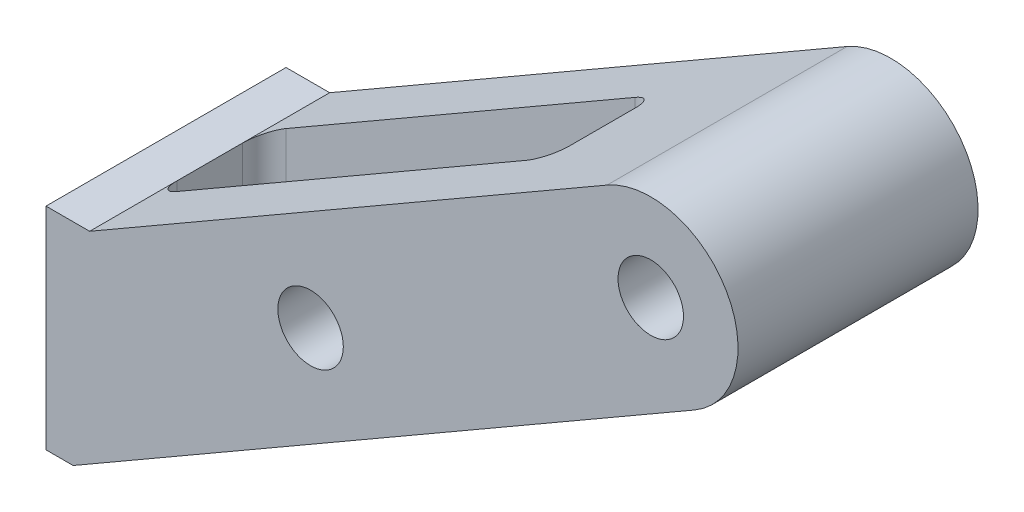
ISO-10303-21;
HEADER;
FILE_DESCRIPTION(('STEP AP214'),'2;1');
FILE_NAME('part.step','',(''),(''),'','','');
FILE_SCHEMA(('AUTOMOTIVE_DESIGN { 1 0 10303 214 1 1 1 1 }'));
ENDSEC;
DATA;
#1=APPLICATION_CONTEXT('core data for automotive mechanical design processes');
#2=APPLICATION_PROTOCOL_DEFINITION('international standard','automotive_design',2000,#1);
#3=PRODUCT_CONTEXT('',#1,'mechanical');
#4=PRODUCT('Part','Part','',(#3));
#5=PRODUCT_RELATED_PRODUCT_CATEGORY('part','',(#4));
#6=PRODUCT_DEFINITION_FORMATION('','',#4);
#7=PRODUCT_DEFINITION_CONTEXT('part definition',#1,'design');
#8=PRODUCT_DEFINITION('design','',#6,#7);
#9=PRODUCT_DEFINITION_SHAPE('','',#8);
#10=(LENGTH_UNIT() NAMED_UNIT(*) SI_UNIT(.MILLI.,.METRE.));
#11=(NAMED_UNIT(*) PLANE_ANGLE_UNIT() SI_UNIT($,.RADIAN.));
#12=(NAMED_UNIT(*) SI_UNIT($,.STERADIAN.) SOLID_ANGLE_UNIT());
#13=UNCERTAINTY_MEASURE_WITH_UNIT(LENGTH_MEASURE(1.E-05),#10,'distance_accuracy_value','');
#14=(GEOMETRIC_REPRESENTATION_CONTEXT(3) GLOBAL_UNCERTAINTY_ASSIGNED_CONTEXT((#13)) GLOBAL_UNIT_ASSIGNED_CONTEXT((#10,
#11,#12)) REPRESENTATION_CONTEXT('',''));
#15=CARTESIAN_POINT('',(0.,0.,0.));
#16=DIRECTION('',(0.,0.,1.));
#17=DIRECTION('',(1.,0.,0.));
#18=AXIS2_PLACEMENT_3D('',#15,#16,#17);
#19=CARTESIAN_POINT('',(24.2487113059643,14.,11.));
#20=DIRECTION('',(0.,0.,1.));
#21=DIRECTION('',(1.,0.,0.));
#22=AXIS2_PLACEMENT_3D('',#19,#20,#21);
#23=CYLINDRICAL_SURFACE('',#22,2.99999999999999);
#24=CARTESIAN_POINT('',(24.2487113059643,14.,-5.));
#25=DIRECTION('',(0.,0.,-1.));
#26=DIRECTION('',(-1.,0.,0.));
#27=AXIS2_PLACEMENT_3D('',#24,#25,#26);
#28=CIRCLE('',#27,2.99999999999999);
#29=CARTESIAN_POINT('',(21.2487113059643,14.,-5.));
#30=VERTEX_POINT('',#29);
#31=EDGE_CURVE('E197',#30,#30,#28,.F.);
#32=ORIENTED_EDGE('',*,*,#31,.T.);
#33=EDGE_LOOP('',(#32));
#34=FACE_BOUND('',#33,.T.);
#35=CARTESIAN_POINT('',(24.2487113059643,14.,-11.));
#36=DIRECTION('',(0.,0.,1.));
#37=DIRECTION('',(1.,0.,0.));
#38=AXIS2_PLACEMENT_3D('',#35,#36,#37);
#39=CIRCLE('',#38,3.);
#40=CARTESIAN_POINT('',(27.2487113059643,14.,-11.));
#41=VERTEX_POINT('',#40);
#42=EDGE_CURVE('E269',#41,#41,#39,.T.);
#43=ORIENTED_EDGE('',*,*,#42,.F.);
#44=EDGE_LOOP('',(#43));
#45=FACE_BOUND('',#44,.T.);
#46=ADVANCED_FACE('F33',(#34,#45),#23,.F.);
#47=CARTESIAN_POINT('',(0.,-9.23760430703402,11.));
#48=DIRECTION('',(1.,0.,0.));
#49=DIRECTION('',(0.,1.,0.));
#50=AXIS2_PLACEMENT_3D('',#47,#48,#49);
#51=PLANE('',#50);
#52=DIRECTION('',(0.,-1.,0.));
#53=VECTOR('',#52,1.);
#54=CARTESIAN_POINT('',(0.,-9.23760430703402,-11.));
#55=LINE('',#54,#53);
#56=CARTESIAN_POINT('',(0.,11.5470053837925,-11.));
#57=VERTEX_POINT('',#56);
#58=CARTESIAN_POINT('',(0.,-7.80196097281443,-11.));
#59=VERTEX_POINT('',#58);
#60=EDGE_CURVE('E158',#57,#59,#55,.T.);
#61=ORIENTED_EDGE('',*,*,#60,.T.);
#62=CARTESIAN_POINT('',(0.,-18.,0.));
#63=DIRECTION('',(-1.,0.,0.));
#64=DIRECTION('',(0.,-1.,0.));
#65=AXIS2_PLACEMENT_3D('',#62,#63,#64);
#66=CIRCLE('',#65,15.);
#67=CARTESIAN_POINT('',(0.,-7.80196097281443,11.));
#68=VERTEX_POINT('',#67);
#69=EDGE_CURVE('E142',#68,#59,#66,.T.);
#70=ORIENTED_EDGE('',*,*,#69,.F.);
#71=DIRECTION('',(0.,-1.,0.));
#72=VECTOR('',#71,1.);
#73=CARTESIAN_POINT('',(0.,-9.23760430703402,11.));
#74=LINE('',#73,#72);
#75=CARTESIAN_POINT('',(0.,11.5470053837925,11.));
#76=VERTEX_POINT('',#75);
#77=EDGE_CURVE('E156',#76,#68,#74,.T.);
#78=ORIENTED_EDGE('',*,*,#77,.F.);
#79=DIRECTION('',(0.,0.,-1.));
#80=VECTOR('',#79,1.);
#81=CARTESIAN_POINT('',(0.,11.5470053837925,11.));
#82=LINE('',#81,#80);
#83=EDGE_CURVE('E178',#76,#57,#82,.T.);
#84=ORIENTED_EDGE('',*,*,#83,.T.);
#85=EDGE_LOOP('',(#61,#70,#78,#84));
#86=FACE_BOUND('',#85,.T.);
#87=ADVANCED_FACE('F35',(#86),#51,.F.);
#88=CARTESIAN_POINT('',(59.425625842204,25.0717967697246,11.));
#89=DIRECTION('',(-0.500000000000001,0.866025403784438,0.));
#90=DIRECTION('',(-0.866025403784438,-0.500000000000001,0.));
#91=AXIS2_PLACEMENT_3D('',#88,#89,#90);
#92=PLANE('',#91);
#93=DIRECTION('',(0.866025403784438,0.500000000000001,0.));
#94=VECTOR('',#93,1.);
#95=CARTESIAN_POINT('',(59.425625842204,25.0717967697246,11.));
#96=LINE('',#95,#94);
#97=CARTESIAN_POINT('',(2.48660719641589,-7.80196097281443,11.));
#98=VERTEX_POINT('',#97);
#99=CARTESIAN_POINT('',(59.4256258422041,25.0717967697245,11.));
#100=VERTEX_POINT('',#99);
#101=EDGE_CURVE('E165',#98,#100,#96,.T.);
#102=ORIENTED_EDGE('',*,*,#101,.F.);
#103=CARTESIAN_POINT('',(-15.1769145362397,-18.,0.));
#104=DIRECTION('',(-0.500000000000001,0.866025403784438,0.));
#105=DIRECTION('',(-0.866025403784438,-0.500000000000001,0.));
#106=AXIS2_PLACEMENT_3D('',#103,#104,#105);
#107=ELLIPSE('',#106,29.9999999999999,15.);
#108=CARTESIAN_POINT('',(9.31798289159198,-3.85786437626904,5.));
#109=VERTEX_POINT('',#108);
#110=EDGE_CURVE('E145',#98,#109,#107,.T.);
#111=ORIENTED_EDGE('',*,*,#110,.T.);
#112=DIRECTION('',(0.866025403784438,0.500000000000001,0.));
#113=VECTOR('',#112,1.);
#114=CARTESIAN_POINT('',(59.425625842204,25.0717967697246,5.));
#115=LINE('',#114,#113);
#116=CARTESIAN_POINT('',(38.,12.7017059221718,5.));
#117=VERTEX_POINT('',#116);
#118=EDGE_CURVE('E201',#109,#117,#115,.T.);
#119=ORIENTED_EDGE('',*,*,#118,.T.);
#120=CARTESIAN_POINT('',(38.,12.7017059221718,3.));
#121=DIRECTION('',(-0.500000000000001,0.866025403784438,0.));
#122=DIRECTION('',(0.866025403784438,0.500000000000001,0.));
#123=AXIS2_PLACEMENT_3D('',#120,#121,#122);
#124=ELLIPSE('',#123,2.30940107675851,2.);
#125=CARTESIAN_POINT('',(40.,13.8564064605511,3.));
#126=VERTEX_POINT('',#125);
#127=EDGE_CURVE('E255',#117,#126,#124,.T.);
#128=ORIENTED_EDGE('',*,*,#127,.T.);
#129=DIRECTION('',(0.,0.,-1.));
#130=VECTOR('',#129,1.);
#131=CARTESIAN_POINT('',(40.,13.8564064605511,11.));
#132=LINE('',#131,#130);
#133=CARTESIAN_POINT('',(40.,13.8564064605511,-3.));
#134=VERTEX_POINT('',#133);
#135=EDGE_CURVE('E258',#126,#134,#132,.T.);
#136=ORIENTED_EDGE('',*,*,#135,.T.);
#137=CARTESIAN_POINT('',(38.,12.7017059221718,-3.));
#138=DIRECTION('',(-0.500000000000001,0.866025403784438,0.));
#139=DIRECTION('',(0.866025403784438,0.500000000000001,0.));
#140=AXIS2_PLACEMENT_3D('',#137,#138,#139);
#141=ELLIPSE('',#140,2.30940107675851,2.);
#142=CARTESIAN_POINT('',(38.,12.7017059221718,-5.));
#143=VERTEX_POINT('',#142);
#144=EDGE_CURVE('E261',#134,#143,#141,.T.);
#145=ORIENTED_EDGE('',*,*,#144,.T.);
#146=DIRECTION('',(-0.866025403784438,-0.500000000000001,0.));
#147=VECTOR('',#146,1.);
#148=CARTESIAN_POINT('',(59.425625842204,25.0717967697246,-5.));
#149=LINE('',#148,#147);
#150=CARTESIAN_POINT('',(9.31798289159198,-3.85786437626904,-5.));
#151=VERTEX_POINT('',#150);
#152=EDGE_CURVE('E227',#143,#151,#149,.T.);
#153=ORIENTED_EDGE('',*,*,#152,.T.);
#154=CARTESIAN_POINT('',(2.48660719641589,-7.80196097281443,-11.));
#155=VERTEX_POINT('',#154);
#156=EDGE_CURVE('E301',#151,#155,#107,.T.);
#157=ORIENTED_EDGE('',*,*,#156,.T.);
#158=DIRECTION('',(0.866025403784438,0.500000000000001,0.));
#159=VECTOR('',#158,1.);
#160=CARTESIAN_POINT('',(59.425625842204,25.0717967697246,-11.));
#161=LINE('',#160,#159);
#162=CARTESIAN_POINT('',(59.4256258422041,25.0717967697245,-11.));
#163=VERTEX_POINT('',#162);
#164=EDGE_CURVE('E276',#155,#163,#161,.T.);
#165=ORIENTED_EDGE('',*,*,#164,.T.);
#166=DIRECTION('',(0.,0.,-1.));
#167=VECTOR('',#166,1.);
#168=CARTESIAN_POINT('',(59.4256258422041,25.0717967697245,11.));
#169=LINE('',#168,#167);
#170=EDGE_CURVE('E188',#100,#163,#169,.T.);
#171=ORIENTED_EDGE('',*,*,#170,.F.);
#172=EDGE_LOOP('',(#102,#111,#119,#128,#136,#145,#153,#157,#165,#171));
#173=FACE_BOUND('',#172,.T.);
#174=ADVANCED_FACE('F347',(#173),#92,.F.);
#175=CARTESIAN_POINT('',(55.4256258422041,32.,11.));
#176=DIRECTION('',(0.,0.,-1.));
#177=DIRECTION('',(-1.,0.,0.));
#178=AXIS2_PLACEMENT_3D('',#175,#176,#177);
#179=CYLINDRICAL_SURFACE('',#178,7.99999999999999);
#180=CARTESIAN_POINT('',(55.4256258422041,32.,-11.));
#181=DIRECTION('',(0.,0.,1.));
#182=DIRECTION('',(1.,0.,0.));
#183=AXIS2_PLACEMENT_3D('',#180,#181,#182);
#184=CIRCLE('',#183,7.99999999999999);
#185=CARTESIAN_POINT('',(51.425625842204,38.9282032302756,-11.));
#186=VERTEX_POINT('',#185);
#187=EDGE_CURVE('E278',#163,#186,#184,.T.);
#188=ORIENTED_EDGE('',*,*,#187,.T.);
#189=DIRECTION('',(0.,0.,-1.));
#190=VECTOR('',#189,1.);
#191=CARTESIAN_POINT('',(51.425625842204,38.9282032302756,11.));
#192=LINE('',#191,#190);
#193=CARTESIAN_POINT('',(51.425625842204,38.9282032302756,11.));
#194=VERTEX_POINT('',#193);
#195=EDGE_CURVE('E184',#194,#186,#192,.T.);
#196=ORIENTED_EDGE('',*,*,#195,.F.);
#197=CARTESIAN_POINT('',(55.4256258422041,32.,11.));
#198=DIRECTION('',(0.,0.,1.));
#199=DIRECTION('',(1.,0.,0.));
#200=AXIS2_PLACEMENT_3D('',#197,#198,#199);
#201=CIRCLE('',#200,7.99999999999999);
#202=EDGE_CURVE('E168',#100,#194,#201,.T.);
#203=ORIENTED_EDGE('',*,*,#202,.F.);
#204=ORIENTED_EDGE('',*,*,#170,.T.);
#205=EDGE_LOOP('',(#188,#196,#203,#204));
#206=FACE_BOUND('',#205,.T.);
#207=ADVANCED_FACE('F345',(#206),#179,.T.);
#208=CARTESIAN_POINT('',(4.,11.5470053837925,11.));
#209=DIRECTION('',(0.500000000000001,-0.866025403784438,0.));
#210=DIRECTION('',(0.866025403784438,0.500000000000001,0.));
#211=AXIS2_PLACEMENT_3D('',#208,#209,#210);
#212=PLANE('',#211);
#213=DIRECTION('',(0.,0.,-1.));
#214=VECTOR('',#213,1.);
#215=CARTESIAN_POINT('',(4.,11.5470053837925,11.));
#216=LINE('',#215,#214);
#217=CARTESIAN_POINT('',(4.,11.5470053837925,-3.));
#218=VERTEX_POINT('',#217);
#219=CARTESIAN_POINT('',(4.,11.5470053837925,-11.));
#220=VERTEX_POINT('',#219);
#221=EDGE_CURVE('E180',#218,#220,#216,.T.);
#222=ORIENTED_EDGE('',*,*,#221,.F.);
#223=CARTESIAN_POINT('',(6.00000000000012,12.7017059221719,-3.));
#224=DIRECTION('',(0.500000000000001,-0.866025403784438,0.));
#225=DIRECTION('',(0.866025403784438,0.500000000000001,0.));
#226=AXIS2_PLACEMENT_3D('',#223,#224,#225);
#227=ELLIPSE('',#226,2.3094010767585,2.);
#228=CARTESIAN_POINT('',(6.00000000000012,12.7017059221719,-5.));
#229=VERTEX_POINT('',#228);
#230=EDGE_CURVE('E253',#218,#229,#227,.T.);
#231=ORIENTED_EDGE('',*,*,#230,.T.);
#232=DIRECTION('',(0.866025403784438,0.500000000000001,0.));
#233=VECTOR('',#232,1.);
#234=CARTESIAN_POINT('',(4.,11.5470053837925,-5.));
#235=LINE('',#234,#233);
#236=CARTESIAN_POINT('',(38.,31.1769145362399,-5.));
#237=VERTEX_POINT('',#236);
#238=EDGE_CURVE('E200',#229,#237,#235,.T.);
#239=ORIENTED_EDGE('',*,*,#238,.T.);
#240=CARTESIAN_POINT('',(38.,31.1769145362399,-3.));
#241=DIRECTION('',(0.500000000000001,-0.866025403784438,0.));
#242=DIRECTION('',(0.866025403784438,0.500000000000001,0.));
#243=AXIS2_PLACEMENT_3D('',#240,#241,#242);
#244=ELLIPSE('',#243,2.30940107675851,2.);
#245=CARTESIAN_POINT('',(40.,32.3316150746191,-3.));
#246=VERTEX_POINT('',#245);
#247=EDGE_CURVE('E41',#237,#246,#244,.T.);
#248=ORIENTED_EDGE('',*,*,#247,.T.);
#249=DIRECTION('',(0.,0.,1.));
#250=VECTOR('',#249,1.);
#251=CARTESIAN_POINT('',(40.,32.3316150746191,11.));
#252=LINE('',#251,#250);
#253=CARTESIAN_POINT('',(40.,32.3316150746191,3.));
#254=VERTEX_POINT('',#253);
#255=EDGE_CURVE('E204',#246,#254,#252,.T.);
#256=ORIENTED_EDGE('',*,*,#255,.T.);
#257=CARTESIAN_POINT('',(38.,31.1769145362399,3.));
#258=DIRECTION('',(0.500000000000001,-0.866025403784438,0.));
#259=DIRECTION('',(0.866025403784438,0.500000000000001,0.));
#260=AXIS2_PLACEMENT_3D('',#257,#258,#259);
#261=ELLIPSE('',#260,2.30940107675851,2.);
#262=CARTESIAN_POINT('',(38.,31.1769145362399,5.));
#263=VERTEX_POINT('',#262);
#264=EDGE_CURVE('E191',#254,#263,#261,.T.);
#265=ORIENTED_EDGE('',*,*,#264,.T.);
#266=DIRECTION('',(-0.866025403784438,-0.500000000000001,0.));
#267=VECTOR('',#266,1.);
#268=CARTESIAN_POINT('',(4.,11.5470053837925,5.));
#269=LINE('',#268,#267);
#270=CARTESIAN_POINT('',(6.00000000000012,12.7017059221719,5.));
#271=VERTEX_POINT('',#270);
#272=EDGE_CURVE('E195',#263,#271,#269,.T.);
#273=ORIENTED_EDGE('',*,*,#272,.T.);
#274=CARTESIAN_POINT('',(6.00000000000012,12.7017059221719,3.));
#275=DIRECTION('',(0.500000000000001,-0.866025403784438,0.));
#276=DIRECTION('',(0.866025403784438,0.500000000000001,0.));
#277=AXIS2_PLACEMENT_3D('',#274,#275,#276);
#278=ELLIPSE('',#277,2.3094010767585,2.);
#279=CARTESIAN_POINT('',(4.00000000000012,11.5470053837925,3.));
#280=VERTEX_POINT('',#279);
#281=EDGE_CURVE('E250',#271,#280,#278,.T.);
#282=ORIENTED_EDGE('',*,*,#281,.T.);
#283=CARTESIAN_POINT('',(4.,11.5470053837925,11.));
#284=VERTEX_POINT('',#283);
#285=EDGE_CURVE('E181',#284,#280,#216,.T.);
#286=ORIENTED_EDGE('',*,*,#285,.F.);
#287=DIRECTION('',(-0.866025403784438,-0.500000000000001,0.));
#288=VECTOR('',#287,1.);
#289=CARTESIAN_POINT('',(4.,11.5470053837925,11.));
#290=LINE('',#289,#288);
#291=EDGE_CURVE('E175',#194,#284,#290,.T.);
#292=ORIENTED_EDGE('',*,*,#291,.F.);
#293=ORIENTED_EDGE('',*,*,#195,.T.);
#294=DIRECTION('',(-0.866025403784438,-0.500000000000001,0.));
#295=VECTOR('',#294,1.);
#296=CARTESIAN_POINT('',(4.,11.5470053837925,-11.));
#297=LINE('',#296,#295);
#298=EDGE_CURVE('E170',#186,#220,#297,.T.);
#299=ORIENTED_EDGE('',*,*,#298,.T.);
#300=EDGE_LOOP('',(#222,#231,#239,#248,#256,#265,#273,#282,#286,#292,#293,#299));
#301=FACE_BOUND('',#300,.T.);
#302=ADVANCED_FACE('F210',(#301),#212,.F.);
#303=CARTESIAN_POINT('',(0.,11.5470053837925,11.));
#304=DIRECTION('',(0.,-1.,0.));
#305=DIRECTION('',(0.,0.,-1.));
#306=AXIS2_PLACEMENT_3D('',#303,#304,#305);
#307=PLANE('',#306);
#308=DIRECTION('',(-1.,0.,0.));
#309=VECTOR('',#308,1.);
#310=CARTESIAN_POINT('',(0.,11.5470053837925,-11.));
#311=LINE('',#310,#309);
#312=EDGE_CURVE('E166',#220,#57,#311,.T.);
#313=ORIENTED_EDGE('',*,*,#312,.T.);
#314=ORIENTED_EDGE('',*,*,#83,.F.);
#315=DIRECTION('',(-1.,0.,0.));
#316=VECTOR('',#315,1.);
#317=CARTESIAN_POINT('',(0.,11.5470053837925,11.));
#318=LINE('',#317,#316);
#319=EDGE_CURVE('E163',#284,#76,#318,.T.);
#320=ORIENTED_EDGE('',*,*,#319,.F.);
#321=ORIENTED_EDGE('',*,*,#285,.T.);
#322=EDGE_CURVE('E185',#280,#218,#216,.T.);
#323=ORIENTED_EDGE('',*,*,#322,.T.);
#324=ORIENTED_EDGE('',*,*,#221,.T.);
#325=EDGE_LOOP('',(#313,#314,#320,#321,#323,#324));
#326=FACE_BOUND('',#325,.T.);
#327=ADVANCED_FACE('F290',(#326),#307,.F.);
#328=CARTESIAN_POINT('',(55.4256258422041,32.,11.));
#329=DIRECTION('',(0.,0.,1.));
#330=DIRECTION('',(1.,0.,0.));
#331=AXIS2_PLACEMENT_3D('',#328,#329,#330);
#332=PLANE('',#331);
#333=DIRECTION('',(-1.,0.,0.));
#334=VECTOR('',#333,1.);
#335=CARTESIAN_POINT('',(63.4256258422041,-7.80196097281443,11.));
#336=LINE('',#335,#334);
#337=EDGE_CURVE('E139',#98,#68,#336,.T.);
#338=ORIENTED_EDGE('',*,*,#337,.F.);
#339=ORIENTED_EDGE('',*,*,#101,.T.);
#340=ORIENTED_EDGE('',*,*,#202,.T.);
#341=ORIENTED_EDGE('',*,*,#291,.T.);
#342=ORIENTED_EDGE('',*,*,#319,.T.);
#343=ORIENTED_EDGE('',*,*,#77,.T.);
#344=EDGE_LOOP('',(#338,#339,#340,#341,#342,#343));
#345=FACE_BOUND('',#344,.T.);
#346=CARTESIAN_POINT('',(55.4256258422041,32.,11.));
#347=DIRECTION('',(0.,0.,1.));
#348=DIRECTION('',(1.,0.,0.));
#349=AXIS2_PLACEMENT_3D('',#346,#347,#348);
#350=CIRCLE('',#349,2.99999999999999);
#351=CARTESIAN_POINT('',(58.4256258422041,32.,11.));
#352=VERTEX_POINT('',#351);
#353=EDGE_CURVE('E266',#352,#352,#350,.T.);
#354=ORIENTED_EDGE('',*,*,#353,.F.);
#355=EDGE_LOOP('',(#354));
#356=FACE_BOUND('',#355,.T.);
#357=CARTESIAN_POINT('',(24.2487113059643,14.,11.));
#358=DIRECTION('',(0.,0.,1.));
#359=DIRECTION('',(1.,0.,0.));
#360=AXIS2_PLACEMENT_3D('',#357,#358,#359);
#361=CIRCLE('',#360,2.99999999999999);
#362=CARTESIAN_POINT('',(27.2487113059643,14.,11.));
#363=VERTEX_POINT('',#362);
#364=EDGE_CURVE('E272',#363,#363,#361,.T.);
#365=ORIENTED_EDGE('',*,*,#364,.F.);
#366=EDGE_LOOP('',(#365));
#367=FACE_BOUND('',#366,.T.);
#368=ADVANCED_FACE('F160',(#345,#356,#367),#332,.T.);
#369=CARTESIAN_POINT('',(55.4256258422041,32.,-11.));
#370=DIRECTION('',(0.,0.,1.));
#371=DIRECTION('',(1.,0.,0.));
#372=AXIS2_PLACEMENT_3D('',#369,#370,#371);
#373=PLANE('',#372);
#374=CARTESIAN_POINT('',(55.4256258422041,32.,-11.));
#375=DIRECTION('',(0.,0.,1.));
#376=DIRECTION('',(1.,0.,0.));
#377=AXIS2_PLACEMENT_3D('',#374,#375,#376);
#378=CIRCLE('',#377,3.);
#379=CARTESIAN_POINT('',(58.4256258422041,32.,-11.));
#380=VERTEX_POINT('',#379);
#381=EDGE_CURVE('E263',#380,#380,#378,.T.);
#382=ORIENTED_EDGE('',*,*,#381,.T.);
#383=EDGE_LOOP('',(#382));
#384=FACE_BOUND('',#383,.T.);
#385=ORIENTED_EDGE('',*,*,#42,.T.);
#386=EDGE_LOOP('',(#385));
#387=FACE_BOUND('',#386,.T.);
#388=ORIENTED_EDGE('',*,*,#164,.F.);
#389=DIRECTION('',(-1.,0.,0.));
#390=VECTOR('',#389,1.);
#391=CARTESIAN_POINT('',(63.4256258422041,-7.80196097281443,-11.));
#392=LINE('',#391,#390);
#393=EDGE_CURVE('E244',#155,#59,#392,.T.);
#394=ORIENTED_EDGE('',*,*,#393,.T.);
#395=ORIENTED_EDGE('',*,*,#60,.F.);
#396=ORIENTED_EDGE('',*,*,#312,.F.);
#397=ORIENTED_EDGE('',*,*,#298,.F.);
#398=ORIENTED_EDGE('',*,*,#187,.F.);
#399=EDGE_LOOP('',(#388,#394,#395,#396,#397,#398));
#400=FACE_BOUND('',#399,.T.);
#401=ADVANCED_FACE('F288',(#384,#387,#400),#373,.F.);
#402=CARTESIAN_POINT('',(24.2487113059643,14.,5.));
#403=DIRECTION('',(0.,0.,1.));
#404=DIRECTION('',(1.,0.,0.));
#405=AXIS2_PLACEMENT_3D('',#402,#403,#404);
#406=CIRCLE('',#405,2.99999999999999);
#407=CARTESIAN_POINT('',(27.2487113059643,14.,5.));
#408=VERTEX_POINT('',#407);
#409=EDGE_CURVE('E192',#408,#408,#406,.F.);
#410=ORIENTED_EDGE('',*,*,#409,.T.);
#411=EDGE_LOOP('',(#410));
#412=FACE_BOUND('',#411,.T.);
#413=ORIENTED_EDGE('',*,*,#364,.T.);
#414=EDGE_LOOP('',(#413));
#415=FACE_BOUND('',#414,.T.);
#416=ADVANCED_FACE('F331',(#412,#415),#23,.F.);
#417=CARTESIAN_POINT('',(55.4256258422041,32.,11.));
#418=DIRECTION('',(0.,0.,1.));
#419=DIRECTION('',(1.,0.,0.));
#420=AXIS2_PLACEMENT_3D('',#417,#418,#419);
#421=CYLINDRICAL_SURFACE('',#420,2.99999999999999);
#422=ORIENTED_EDGE('',*,*,#381,.F.);
#423=EDGE_LOOP('',(#422));
#424=FACE_BOUND('',#423,.T.);
#425=ORIENTED_EDGE('',*,*,#353,.T.);
#426=EDGE_LOOP('',(#425));
#427=FACE_BOUND('',#426,.T.);
#428=ADVANCED_FACE('F328',(#424,#427),#421,.F.);
#429=CARTESIAN_POINT('',(38.,-9.23760430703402,-3.));
#430=DIRECTION('',(0.,1.,0.));
#431=DIRECTION('',(0.,0.,1.));
#432=AXIS2_PLACEMENT_3D('',#429,#430,#431);
#433=CYLINDRICAL_SURFACE('',#432,2.);
#434=DIRECTION('',(0.,1.,0.));
#435=VECTOR('',#434,1.);
#436=CARTESIAN_POINT('',(40.,-9.23760430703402,-3.));
#437=LINE('',#436,#435);
#438=EDGE_CURVE('E221',#134,#246,#437,.T.);
#439=ORIENTED_EDGE('',*,*,#438,.T.);
#440=ORIENTED_EDGE('',*,*,#247,.F.);
#441=DIRECTION('',(0.,1.,0.));
#442=VECTOR('',#441,1.);
#443=CARTESIAN_POINT('',(38.,-9.23760430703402,-5.));
#444=LINE('',#443,#442);
#445=EDGE_CURVE('E218',#143,#237,#444,.T.);
#446=ORIENTED_EDGE('',*,*,#445,.F.);
#447=ORIENTED_EDGE('',*,*,#144,.F.);
#448=EDGE_LOOP('',(#439,#440,#446,#447));
#449=FACE_BOUND('',#448,.T.);
#450=ADVANCED_FACE('F217',(#449),#433,.F.);
#451=CARTESIAN_POINT('',(40.,-9.23760430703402,3.));
#452=DIRECTION('',(1.,0.,0.));
#453=DIRECTION('',(0.,0.,-1.));
#454=AXIS2_PLACEMENT_3D('',#451,#452,#453);
#455=PLANE('',#454);
#456=DIRECTION('',(0.,1.,0.));
#457=VECTOR('',#456,1.);
#458=CARTESIAN_POINT('',(40.,-9.23760430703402,3.));
#459=LINE('',#458,#457);
#460=EDGE_CURVE('E230',#126,#254,#459,.T.);
#461=ORIENTED_EDGE('',*,*,#460,.T.);
#462=ORIENTED_EDGE('',*,*,#255,.F.);
#463=ORIENTED_EDGE('',*,*,#438,.F.);
#464=ORIENTED_EDGE('',*,*,#135,.F.);
#465=EDGE_LOOP('',(#461,#462,#463,#464));
#466=FACE_BOUND('',#465,.T.);
#467=ADVANCED_FACE('F384',(#466),#455,.F.);
#468=CARTESIAN_POINT('',(38.,-9.23760430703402,3.));
#469=DIRECTION('',(0.,1.,0.));
#470=DIRECTION('',(0.,0.,1.));
#471=AXIS2_PLACEMENT_3D('',#468,#469,#470);
#472=CYLINDRICAL_SURFACE('',#471,2.);
#473=DIRECTION('',(0.,1.,0.));
#474=VECTOR('',#473,1.);
#475=CARTESIAN_POINT('',(38.,-9.23760430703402,5.));
#476=LINE('',#475,#474);
#477=EDGE_CURVE('E236',#117,#263,#476,.T.);
#478=ORIENTED_EDGE('',*,*,#477,.T.);
#479=ORIENTED_EDGE('',*,*,#264,.F.);
#480=ORIENTED_EDGE('',*,*,#460,.F.);
#481=ORIENTED_EDGE('',*,*,#127,.F.);
#482=EDGE_LOOP('',(#478,#479,#480,#481));
#483=FACE_BOUND('',#482,.T.);
#484=ADVANCED_FACE('F326',(#483),#472,.F.);
#485=CARTESIAN_POINT('',(6.00000000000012,-9.23760430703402,-3.));
#486=DIRECTION('',(0.,1.,0.));
#487=DIRECTION('',(0.,0.,1.));
#488=AXIS2_PLACEMENT_3D('',#485,#486,#487);
#489=CYLINDRICAL_SURFACE('',#488,2.);
#490=DIRECTION('',(0.,1.,0.));
#491=VECTOR('',#490,1.);
#492=CARTESIAN_POINT('',(4.00000000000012,-9.23760430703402,-3.));
#493=LINE('',#492,#491);
#494=CARTESIAN_POINT('',(4.00000000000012,-3.30306154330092,-3.));
#495=VERTEX_POINT('',#494);
#496=EDGE_CURVE('E55',#495,#218,#493,.T.);
#497=ORIENTED_EDGE('',*,*,#496,.F.);
#498=CARTESIAN_POINT('',(6.00000000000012,-3.03337045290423,-1.));
#499=CARTESIAN_POINT('',(5.88794812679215,-3.03336970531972,-1.00000458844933));
#500=CARTESIAN_POINT('',(5.77582792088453,-3.03399241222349,-1.00944722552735));
#501=CARTESIAN_POINT('',(5.55468691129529,-3.03657192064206,-1.04697703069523));
#502=CARTESIAN_POINT('',(5.44566938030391,-3.03853008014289,-1.07508317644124));
#503=CARTESIAN_POINT('',(5.23394418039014,-3.04403547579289,-1.14912820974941));
#504=CARTESIAN_POINT('',(5.13123428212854,-3.0475821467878,-1.1950607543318));
#505=CARTESIAN_POINT('',(4.93503888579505,-3.05663823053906,-1.30341093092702));
#506=CARTESIAN_POINT('',(4.84155134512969,-3.06214720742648,-1.36582490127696));
#507=CARTESIAN_POINT('',(4.66650441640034,-3.07555269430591,-1.50524334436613));
#508=CARTESIAN_POINT('',(4.58493469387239,-3.08344711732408,-1.58223504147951));
#509=CARTESIAN_POINT('',(4.43591596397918,-3.10202920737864,-1.74855736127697));
#510=CARTESIAN_POINT('',(4.36846705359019,-3.11271689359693,-1.8378880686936));
#511=CARTESIAN_POINT('',(4.24954050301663,-3.1371766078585,-2.02619828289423));
#512=CARTESIAN_POINT('',(4.19805899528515,-3.15094788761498,-2.12517544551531));
#513=CARTESIAN_POINT('',(4.11234708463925,-3.18168611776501,-2.32986607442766));
#514=CARTESIAN_POINT('',(4.07811702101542,-3.19865313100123,-2.43557967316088));
#515=CARTESIAN_POINT('',(4.02744286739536,-3.23580714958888,-2.65154738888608));
#516=CARTESIAN_POINT('',(4.01114260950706,-3.256018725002,-2.76183096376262));
#517=CARTESIAN_POINT('',(3.99700208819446,-3.29917753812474,-2.98303917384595));
#518=CARTESIAN_POINT('',(3.99916384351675,-3.32212507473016,-3.09396387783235));
#519=CARTESIAN_POINT('',(4.0218820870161,-3.3706307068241,-3.31582878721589));
#520=CARTESIAN_POINT('',(4.0428292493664,-3.39623398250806,-3.42671903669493));
#521=CARTESIAN_POINT('',(4.10290275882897,-3.44871565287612,-3.64314929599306));
#522=CARTESIAN_POINT('',(4.14203220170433,-3.47559426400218,-3.74868839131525));
#523=CARTESIAN_POINT('',(4.2385494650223,-3.53017243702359,-3.95419692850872));
#524=CARTESIAN_POINT('',(4.29636122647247,-3.55787597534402,-4.05396649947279));
#525=CARTESIAN_POINT('',(4.42843372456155,-3.6120829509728,-4.24234181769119));
#526=CARTESIAN_POINT('',(4.50269599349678,-3.63858627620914,-4.33094652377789));
#527=CARTESIAN_POINT('',(4.66600226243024,-3.68895874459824,-4.49460306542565));
#528=CARTESIAN_POINT('',(4.75507634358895,-3.71282235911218,-4.56962665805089));
#529=CARTESIAN_POINT('',(4.94559604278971,-3.75631935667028,-4.70345942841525));
#530=CARTESIAN_POINT('',(5.04703878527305,-3.77595372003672,-4.76227236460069));
#531=CARTESIAN_POINT('',(5.25551946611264,-3.80895203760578,-4.85970361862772));
#532=CARTESIAN_POINT('',(5.36221491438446,-3.82251986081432,-4.89898449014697));
#533=CARTESIAN_POINT('',(5.58128365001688,-3.84338841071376,-4.95896894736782));
#534=CARTESIAN_POINT('',(5.69365474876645,-3.85069153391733,-4.97967963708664));
#535=CARTESIAN_POINT('',(5.91470537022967,-3.85825111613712,-5.0011056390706));
#536=CARTESIAN_POINT('',(6.02328043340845,-3.85884832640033,-5.00278788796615));
#537=CARTESIAN_POINT('',(6.23912113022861,-3.85383564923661,-4.98859600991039));
#538=CARTESIAN_POINT('',(6.34638691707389,-3.84822649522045,-4.97272395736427));
#539=CARTESIAN_POINT('',(6.55464698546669,-3.83136566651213,-4.9244726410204));
#540=CARTESIAN_POINT('',(6.65571845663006,-3.82021512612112,-4.89238907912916));
#541=CARTESIAN_POINT('',(6.85098351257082,-3.79307006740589,-4.81299203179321));
#542=CARTESIAN_POINT('',(6.94517619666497,-3.77707491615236,-4.76567655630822));
#543=CARTESIAN_POINT('',(7.12725609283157,-3.74065304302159,-4.65558566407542));
#544=CARTESIAN_POINT('',(7.21485376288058,-3.72010331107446,-4.59237280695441));
#545=CARTESIAN_POINT('',(7.37836362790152,-3.67607746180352,-4.45315236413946));
#546=CARTESIAN_POINT('',(7.45427287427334,-3.65260060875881,-4.37714156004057));
#547=CARTESIAN_POINT('',(7.5962905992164,-3.60268867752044,-4.21015272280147));
#548=CARTESIAN_POINT('',(7.66170434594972,-3.57616387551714,-4.11861011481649));
#549=CARTESIAN_POINT('',(7.77625886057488,-3.52255011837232,-3.92599473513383));
#550=CARTESIAN_POINT('',(7.82539653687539,-3.49546105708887,-3.82492015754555));
#551=CARTESIAN_POINT('',(7.90733131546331,-3.44112885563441,-3.61270066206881));
#552=CARTESIAN_POINT('',(7.93959866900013,-3.41390511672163,-3.5013455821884));
#553=CARTESIAN_POINT('',(7.9844734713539,-3.3612706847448,-3.27432047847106));
#554=CARTESIAN_POINT('',(7.99708137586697,-3.33585994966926,-3.15865055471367));
#555=CARTESIAN_POINT('',(8.00199870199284,-3.28790460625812,-2.92713549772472));
#556=CARTESIAN_POINT('',(7.9944520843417,-3.26534086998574,-2.81129748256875));
#557=CARTESIAN_POINT('',(7.95928555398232,-3.22345459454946,-2.58210653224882));
#558=CARTESIAN_POINT('',(7.9316686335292,-3.20413157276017,-2.46875322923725));
#559=CARTESIAN_POINT('',(7.85789339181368,-3.16945011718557,-2.25092318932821));
#560=CARTESIAN_POINT('',(7.81222867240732,-3.15400272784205,-2.14629336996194));
#561=CARTESIAN_POINT('',(7.70354347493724,-3.12642226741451,-1.94599957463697));
#562=CARTESIAN_POINT('',(7.64052540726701,-3.11428873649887,-1.85033435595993));
#563=CARTESIAN_POINT('',(7.50024777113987,-3.09328771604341,-1.67266172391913));
#564=CARTESIAN_POINT('',(7.42328139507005,-3.08436257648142,-1.5904294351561));
#565=CARTESIAN_POINT('',(7.25648814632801,-3.06907994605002,-1.439918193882));
#566=CARTESIAN_POINT('',(7.16665901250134,-3.0627229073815,-1.37164169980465));
#567=CARTESIAN_POINT('',(6.97720451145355,-3.05216953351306,-1.25139969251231));
#568=CARTESIAN_POINT('',(6.8776298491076,-3.047962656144,-1.19935509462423));
#569=CARTESIAN_POINT('',(6.6712000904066,-3.04126137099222,-1.11267448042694));
#570=CARTESIAN_POINT('',(6.56435246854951,-3.03876523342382,-1.07802088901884));
#571=CARTESIAN_POINT('',(6.3808416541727,-3.03574720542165,-1.03509842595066));
#572=CARTESIAN_POINT('',(6.30528733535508,-3.03485094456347,-1.02195503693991));
#573=CARTESIAN_POINT('',(6.15316599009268,-3.03366282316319,-1.00440424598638));
#574=CARTESIAN_POINT('',(6.07659896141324,-3.03337096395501,-0.99999686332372));
#575=CARTESIAN_POINT('',(6.00000000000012,-3.03337045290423,-1.));
#576=B_SPLINE_CURVE_WITH_KNOTS('',3,(#498,#499,#500,#501,#502,#503,#504,#505,#506,#507,#508,
#509,#510,#511,#512,#513,#514,#515,#516,#517,#518,#519,#520,#521,#522,#523,#524,#525,#526,#527,
#528,#529,#530,#531,#532,#533,#534,#535,#536,#537,#538,#539,#540,#541,#542,#543,#544,#545,#546,
#547,#548,#549,#550,#551,#552,#553,#554,#555,#556,#557,#558,#559,#560,#561,#562,#563,#564,#565,
#566,#567,#568,#569,#570,#571,#572,#573,#574,#575),.UNSPECIFIED.,.T.,.F.,(4,2,2,2,2,2,2,2,2,2,2,
2,2,2,2,2,2,2,2,2,2,2,2,2,2,2,2,2,2,2,2,2,2,2,2,2,2,2,4),(0.,0.335877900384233,
0.672097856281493,1.00819828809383,1.3442241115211,1.67995680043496,2.01569179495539,
2.35134540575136,2.68700561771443,3.02533927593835,3.36370993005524,3.70928505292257,
4.05491903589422,4.40902312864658,4.76316021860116,5.11802550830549,5.47280845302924,
5.81455687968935,6.1561745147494,6.4803497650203,6.80448671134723,7.12291393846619,
7.44138278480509,7.76981712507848,8.09833418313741,8.44355788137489,8.78884711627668,
9.1444109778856,9.49996659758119,9.85298934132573,10.205959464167,10.5498786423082,
10.8937500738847,11.2310909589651,11.5684912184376,11.9042209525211,12.2396107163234,
12.4692172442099,12.6988242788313),.UNSPECIFIED.);
#577=CARTESIAN_POINT('',(6.00000000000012,-3.85786437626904,-5.));
#578=VERTEX_POINT('',#577);
#579=EDGE_CURVE('E150',#495,#578,#576,.T.);
#580=ORIENTED_EDGE('',*,*,#579,.T.);
#581=DIRECTION('',(0.,1.,0.));
#582=VECTOR('',#581,1.);
#583=CARTESIAN_POINT('',(6.00000000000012,-9.23760430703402,-5.));
#584=LINE('',#583,#582);
#585=EDGE_CURVE('E196',#578,#229,#584,.T.);
#586=ORIENTED_EDGE('',*,*,#585,.T.);
#587=ORIENTED_EDGE('',*,*,#230,.F.);
#588=EDGE_LOOP('',(#497,#580,#586,#587));
#589=FACE_BOUND('',#588,.T.);
#590=ADVANCED_FACE('F322',(#589),#489,.F.);
#591=CARTESIAN_POINT('',(6.00000000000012,-9.23760430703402,3.));
#592=DIRECTION('',(0.,1.,0.));
#593=DIRECTION('',(0.,0.,1.));
#594=AXIS2_PLACEMENT_3D('',#591,#592,#593);
#595=CYLINDRICAL_SURFACE('',#594,2.);
#596=DIRECTION('',(0.,1.,0.));
#597=VECTOR('',#596,1.);
#598=CARTESIAN_POINT('',(6.00000000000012,-9.23760430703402,5.));
#599=LINE('',#598,#597);
#600=CARTESIAN_POINT('',(6.00000000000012,-3.85786437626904,5.));
#601=VERTEX_POINT('',#600);
#602=EDGE_CURVE('E239',#601,#271,#599,.T.);
#603=ORIENTED_EDGE('',*,*,#602,.F.);
#604=CARTESIAN_POINT('',(6.00000000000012,-3.85786437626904,5.));
#605=CARTESIAN_POINT('',(5.89185830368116,-3.85786145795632,4.99999480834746));
#606=CARTESIAN_POINT('',(5.78364803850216,-3.85474066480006,4.99119178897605));
#607=CARTESIAN_POINT('',(5.57033563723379,-3.84247716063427,4.95629639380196));
#608=CARTESIAN_POINT('',(5.46523693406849,-3.8333280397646,4.93018561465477));
#609=CARTESIAN_POINT('',(5.26135846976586,-3.80968231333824,4.86170583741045));
#610=CARTESIAN_POINT('',(5.16256690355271,-3.79519606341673,4.81936831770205));
#611=CARTESIAN_POINT('',(4.97361092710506,-3.76182514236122,4.71986421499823));
#612=CARTESIAN_POINT('',(4.88344614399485,-3.74294066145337,4.66269827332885));
#613=CARTESIAN_POINT('',(4.71125928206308,-3.7012692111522,4.53332551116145));
#614=CARTESIAN_POINT('',(4.62956115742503,-3.67838246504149,4.46072017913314));
#615=CARTESIAN_POINT('',(4.47932656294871,-3.63038751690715,4.30360067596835));
#616=CARTESIAN_POINT('',(4.41079339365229,-3.60527876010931,4.21908352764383));
#617=CARTESIAN_POINT('',(4.28544479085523,-3.55283488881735,4.03595192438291));
#618=CARTESIAN_POINT('',(4.2293555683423,-3.52545082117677,3.93685362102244));
#619=CARTESIAN_POINT('',(4.13473707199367,-3.4709082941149,3.73053285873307));
#620=CARTESIAN_POINT('',(4.09621024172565,-3.44374986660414,3.62330927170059));
#621=CARTESIAN_POINT('',(4.03731552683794,-3.39032736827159,3.40157171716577));
#622=CARTESIAN_POINT('',(4.01728669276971,-3.36408816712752,3.2869613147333));
#623=CARTESIAN_POINT('',(3.99739858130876,-3.31401848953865,3.055480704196));
#624=CARTESIAN_POINT('',(3.99753750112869,-3.29018779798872,2.93861069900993));
#625=CARTESIAN_POINT('',(4.01810728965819,-3.24599846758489,2.70795318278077));
#626=CARTESIAN_POINT('',(4.038212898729,-3.22559030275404,2.59414628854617));
#627=CARTESIAN_POINT('',(4.09792176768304,-3.18817115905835,2.37118241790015));
#628=CARTESIAN_POINT('',(4.13752215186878,-3.17115967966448,2.26202475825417));
#629=CARTESIAN_POINT('',(4.23398582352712,-3.1410055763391,2.0545102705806));
#630=CARTESIAN_POINT('',(4.29038079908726,-3.12777499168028,1.95594836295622));
#631=CARTESIAN_POINT('',(4.41923906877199,-3.10444496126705,1.76954101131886));
#632=CARTESIAN_POINT('',(4.49170105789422,-3.09434526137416,1.68169469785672));
#633=CARTESIAN_POINT('',(4.64948597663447,-3.0770551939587,1.52059355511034));
#634=CARTESIAN_POINT('',(4.73460915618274,-3.06982510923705,1.4471472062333));
#635=CARTESIAN_POINT('',(4.91605359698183,-3.05764707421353,1.31547507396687));
#636=CARTESIAN_POINT('',(5.01237467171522,-3.0526990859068,1.25724903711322));
#637=CARTESIAN_POINT('',(5.21322717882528,-3.04467069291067,1.15785050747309));
#638=CARTESIAN_POINT('',(5.3177383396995,-3.04158583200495,1.11663739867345));
#639=CARTESIAN_POINT('',(5.53221025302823,-3.03691848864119,1.05225548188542));
#640=CARTESIAN_POINT('',(5.6421710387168,-3.03533601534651,1.02908678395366));
#641=CARTESIAN_POINT('',(5.86457658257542,-3.03346031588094,1.00144195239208));
#642=CARTESIAN_POINT('',(5.97702443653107,-3.03316879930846,0.996990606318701));
#643=CARTESIAN_POINT('',(6.20107511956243,-3.03383741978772,1.00697629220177));
#644=CARTESIAN_POINT('',(6.3126779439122,-3.03479756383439,1.02141342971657));
#645=CARTESIAN_POINT('',(6.53193478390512,-3.03810578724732,1.06877463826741));
#646=CARTESIAN_POINT('',(6.63958653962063,-3.04045464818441,1.1017091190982));
#647=CARTESIAN_POINT('',(6.84781221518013,-3.0468320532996,1.18511906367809));
#648=CARTESIAN_POINT('',(6.94838618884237,-3.05086058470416,1.23559439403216));
#649=CARTESIAN_POINT('',(7.13951454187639,-3.06099056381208,1.35256291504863));
#650=CARTESIAN_POINT('',(7.23007704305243,-3.06709031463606,1.41904298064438));
#651=CARTESIAN_POINT('',(7.39870732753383,-3.08179496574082,1.566078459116));
#652=CARTESIAN_POINT('',(7.47677543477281,-3.09039980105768,1.64663350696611));
#653=CARTESIAN_POINT('',(7.61815435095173,-3.11048626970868,1.81931644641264));
#654=CARTESIAN_POINT('',(7.68148246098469,-3.12196449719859,1.91143057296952));
#655=CARTESIAN_POINT('',(7.79180231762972,-3.14805368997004,2.10456014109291));
#656=CARTESIAN_POINT('',(7.83879415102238,-3.16266463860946,2.20557553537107));
#657=CARTESIAN_POINT('',(7.91544084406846,-3.19513541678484,2.41394635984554));
#658=CARTESIAN_POINT('',(7.94502644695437,-3.21300785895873,2.52132527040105));
#659=CARTESIAN_POINT('',(7.98598267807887,-3.25177039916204,2.73896717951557));
#660=CARTESIAN_POINT('',(7.99735184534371,-3.27266073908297,2.84923040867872));
#661=CARTESIAN_POINT('',(8.00186157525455,-3.31737790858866,3.07142636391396));
#662=CARTESIAN_POINT('',(7.99469757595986,-3.34124758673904,3.18335654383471));
#663=CARTESIAN_POINT('',(7.96193716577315,-3.39091801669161,3.40404580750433));
#664=CARTESIAN_POINT('',(7.93633789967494,-3.41671906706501,3.51280439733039));
#665=CARTESIAN_POINT('',(7.86664699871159,-3.46998366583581,3.72708028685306));
#666=CARTESIAN_POINT('',(7.82209595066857,-3.49747291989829,3.83244190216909));
#667=CARTESIAN_POINT('',(7.71570086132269,-3.55226878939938,4.03410403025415));
#668=CARTESIAN_POINT('',(7.65385473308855,-3.57957538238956,4.13040344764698));
#669=CARTESIAN_POINT('',(7.51347155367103,-3.63298894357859,4.31255510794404));
#670=CARTESIAN_POINT('',(7.43472169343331,-3.65907490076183,4.39824984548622));
#671=CARTESIAN_POINT('',(7.26299321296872,-3.70812314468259,4.55510998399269));
#672=CARTESIAN_POINT('',(7.17001283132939,-3.73108504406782,4.62627358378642));
#673=CARTESIAN_POINT('',(6.9745284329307,-3.7718852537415,4.75025560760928));
#674=CARTESIAN_POINT('',(6.87228373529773,-3.78982661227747,4.80344852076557));
#675=CARTESIAN_POINT('',(6.65952873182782,-3.81993570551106,4.89162261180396));
#676=CARTESIAN_POINT('',(6.54903141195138,-3.83211229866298,4.92663173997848));
#677=CARTESIAN_POINT('',(6.36476887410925,-3.84651863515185,4.96781979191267));
#678=CARTESIAN_POINT('',(6.29241781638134,-3.85075909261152,4.97986490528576));
#679=CARTESIAN_POINT('',(6.1467216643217,-3.85643288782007,4.99595658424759));
#680=CARTESIAN_POINT('',(6.07337661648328,-3.85786635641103,5.00000352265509));
#681=CARTESIAN_POINT('',(6.00000000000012,-3.85786437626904,5.));
#682=B_SPLINE_CURVE_WITH_KNOTS('',3,(#604,#605,#606,#607,#608,#609,#610,#611,#612,#613,#614,
#615,#616,#617,#618,#619,#620,#621,#622,#623,#624,#625,#626,#627,#628,#629,#630,#631,#632,#633,
#634,#635,#636,#637,#638,#639,#640,#641,#642,#643,#644,#645,#646,#647,#648,#649,#650,#651,#652,
#653,#654,#655,#656,#657,#658,#659,#660,#661,#662,#663,#664,#665,#666,#667,#668,#669,#670,#671,
#672,#673,#674,#675,#676,#677,#678,#679,#680,#681),.UNSPECIFIED.,.T.,.F.,(4,2,2,2,2,2,2,2,2,2,2,
2,2,2,2,2,2,2,2,2,2,2,2,2,2,2,2,2,2,2,2,2,2,2,2,2,2,2,4),(0.,0.324148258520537,
0.648641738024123,0.972508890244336,1.29636203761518,1.62989550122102,1.96351247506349,
2.3132497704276,2.66303571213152,3.01911255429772,3.37515756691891,3.72549616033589,
4.0757830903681,4.4170948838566,4.75837896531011,5.09475936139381,5.43113415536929,
5.76670119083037,6.10227027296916,6.43828361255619,6.77429882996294,7.11050333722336,
7.4467052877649,7.78263246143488,8.11855092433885,8.45407309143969,8.78959347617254,
9.1264399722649,9.46331348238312,9.80575798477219,10.1482555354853,10.4995765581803,
10.8509399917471,11.2070176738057,11.5631394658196,11.9113014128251,12.2589266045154,
12.4788788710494,12.6988208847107),.UNSPECIFIED.);
#683=CARTESIAN_POINT('',(3.99999999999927,-3.3030615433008,2.99999999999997));
#684=VERTEX_POINT('',#683);
#685=EDGE_CURVE('E48',#601,#684,#682,.T.);
#686=ORIENTED_EDGE('',*,*,#685,.T.);
#687=DIRECTION('',(0.,1.,0.));
#688=VECTOR('',#687,1.);
#689=CARTESIAN_POINT('',(4.00000000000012,-9.23760430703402,3.));
#690=LINE('',#689,#688);
#691=EDGE_CURVE('E241',#684,#280,#690,.T.);
#692=ORIENTED_EDGE('',*,*,#691,.T.);
#693=ORIENTED_EDGE('',*,*,#281,.F.);
#694=EDGE_LOOP('',(#603,#686,#692,#693));
#695=FACE_BOUND('',#694,.T.);
#696=ADVANCED_FACE('F297',(#695),#595,.F.);
#697=CARTESIAN_POINT('',(4.00000000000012,-9.23760430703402,3.));
#698=DIRECTION('',(-1.,0.,0.));
#699=DIRECTION('',(0.,0.,1.));
#700=AXIS2_PLACEMENT_3D('',#697,#698,#699);
#701=PLANE('',#700);
#702=ORIENTED_EDGE('',*,*,#691,.F.);
#703=CARTESIAN_POINT('',(4.00000000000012,-18.,0.));
#704=DIRECTION('',(-1.,0.,0.));
#705=DIRECTION('',(0.,0.,1.));
#706=AXIS2_PLACEMENT_3D('',#703,#704,#705);
#707=CIRCLE('',#706,15.);
#708=EDGE_CURVE('E299',#684,#495,#707,.T.);
#709=ORIENTED_EDGE('',*,*,#708,.T.);
#710=ORIENTED_EDGE('',*,*,#496,.T.);
#711=ORIENTED_EDGE('',*,*,#322,.F.);
#712=EDGE_LOOP('',(#702,#709,#710,#711));
#713=FACE_BOUND('',#712,.T.);
#714=ADVANCED_FACE('F293',(#713),#701,.F.);
#715=CARTESIAN_POINT('',(6.00000000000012,-9.23760430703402,-5.));
#716=DIRECTION('',(0.,0.,-1.));
#717=DIRECTION('',(-1.,0.,0.));
#718=AXIS2_PLACEMENT_3D('',#715,#716,#717);
#719=PLANE('',#718);
#720=ORIENTED_EDGE('',*,*,#31,.F.);
#721=EDGE_LOOP('',(#720));
#722=FACE_BOUND('',#721,.T.);
#723=ORIENTED_EDGE('',*,*,#585,.F.);
#724=DIRECTION('',(-1.,0.,0.));
#725=VECTOR('',#724,1.);
#726=CARTESIAN_POINT('',(63.4256258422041,-3.85786437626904,-5.));
#727=LINE('',#726,#725);
#728=EDGE_CURVE('E149',#578,#151,#727,.F.);
#729=ORIENTED_EDGE('',*,*,#728,.T.);
#730=ORIENTED_EDGE('',*,*,#152,.F.);
#731=ORIENTED_EDGE('',*,*,#445,.T.);
#732=ORIENTED_EDGE('',*,*,#238,.F.);
#733=EDGE_LOOP('',(#723,#729,#730,#731,#732));
#734=FACE_BOUND('',#733,.T.);
#735=ADVANCED_FACE('F224',(#722,#734),#719,.F.);
#736=CARTESIAN_POINT('',(6.00000000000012,-9.23760430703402,5.));
#737=DIRECTION('',(0.,0.,1.));
#738=DIRECTION('',(1.,0.,0.));
#739=AXIS2_PLACEMENT_3D('',#736,#737,#738);
#740=PLANE('',#739);
#741=ORIENTED_EDGE('',*,*,#409,.F.);
#742=EDGE_LOOP('',(#741));
#743=FACE_BOUND('',#742,.T.);
#744=ORIENTED_EDGE('',*,*,#118,.F.);
#745=DIRECTION('',(-1.,0.,0.));
#746=VECTOR('',#745,1.);
#747=CARTESIAN_POINT('',(63.4256258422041,-3.85786437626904,5.));
#748=LINE('',#747,#746);
#749=EDGE_CURVE('E11',#109,#601,#748,.T.);
#750=ORIENTED_EDGE('',*,*,#749,.T.);
#751=ORIENTED_EDGE('',*,*,#602,.T.);
#752=ORIENTED_EDGE('',*,*,#272,.F.);
#753=ORIENTED_EDGE('',*,*,#477,.F.);
#754=EDGE_LOOP('',(#744,#750,#751,#752,#753));
#755=FACE_BOUND('',#754,.T.);
#756=ADVANCED_FACE('F313',(#743,#755),#740,.F.);
#757=CARTESIAN_POINT('',(63.4256258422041,-18.,0.));
#758=DIRECTION('',(-1.,0.,0.));
#759=DIRECTION('',(0.,-1.,0.));
#760=AXIS2_PLACEMENT_3D('',#757,#758,#759);
#761=CYLINDRICAL_SURFACE('',#760,15.);
#762=ORIENTED_EDGE('',*,*,#156,.F.);
#763=ORIENTED_EDGE('',*,*,#728,.F.);
#764=ORIENTED_EDGE('',*,*,#579,.F.);
#765=ORIENTED_EDGE('',*,*,#708,.F.);
#766=ORIENTED_EDGE('',*,*,#685,.F.);
#767=ORIENTED_EDGE('',*,*,#749,.F.);
#768=ORIENTED_EDGE('',*,*,#110,.F.);
#769=ORIENTED_EDGE('',*,*,#337,.T.);
#770=ORIENTED_EDGE('',*,*,#69,.T.);
#771=ORIENTED_EDGE('',*,*,#393,.F.);
#772=EDGE_LOOP('',(#762,#763,#764,#765,#766,#767,#768,#769,#770,#771));
#773=FACE_BOUND('',#772,.T.);
#774=ADVANCED_FACE('F141',(#773),#761,.F.);
#775=CLOSED_SHELL('',(#46,#87,#174,#207,#302,#327,#368,#401,#416,#428,#450,#467,#484,#590,#696,
#714,#735,#756,#774));
#776=MANIFOLD_SOLID_BREP('B2',#775);
#777=ADVANCED_BREP_SHAPE_REPRESENTATION('',(#18,#776),#14);
#778=SHAPE_DEFINITION_REPRESENTATION(#9,#777);
ENDSEC;
END-ISO-10303-21;
